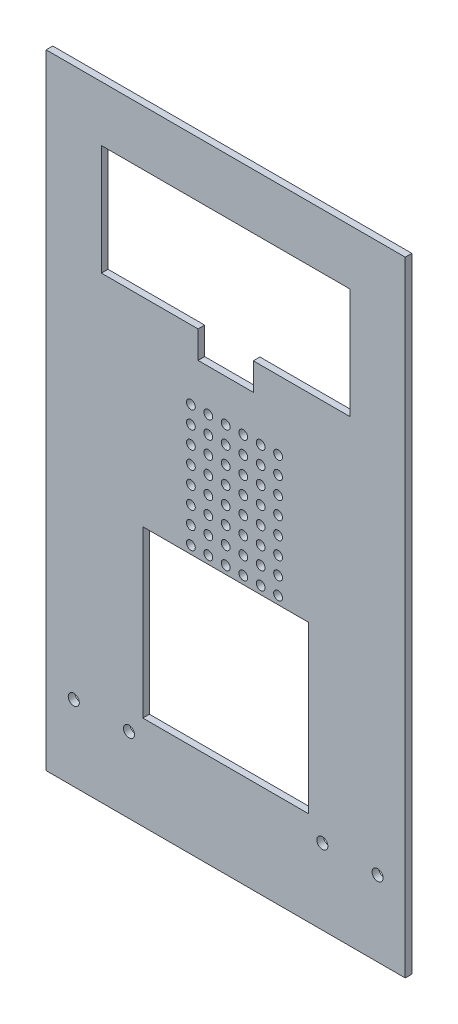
from build123d import *

# Parameters (mm, degrees)
SKETCH1_W           = 165.1
SKETCH1_H           = 292.1
BOSS_EXTRUDE1_DEPTH = 3.048
SKETCH2_R           = 10.7315
SKETCH2_R_2         = 2.0193
SKETCH2_W           = 16.173788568
SKETCH2_H           = 32.6898
SKETCH2_W_2         = 76.2
SKETCH2_H_2         = 76.2
CUT_EXTRUDE1_DEPTH  = 168.792715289
CUT_EXTRUDE2_DEPTH  = 168.792715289
SKETCH5_R           = 2.54
CUT_EXTRUDE3_DEPTH  = 168.792715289
SKETCH6_W           = 165.1
SKETCH6_H           = 5.08
CUT_EXTRUDE4_DEPTH  = 168.792715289


with BuildPart() as part:
    # Sketch1 → Boss-Extrude1 (new body)
    with BuildSketch(Plane.XY):
        Rectangle(SKETCH1_W, SKETCH1_H)
    extrude(amount=BOSS_EXTRUDE1_DEPTH)

    # Sketch2 → Cut-Extrude1 (cut, through all)
    with BuildSketch(Plane.XY):
        with Locations((0, 92.71)):
            Circle(SKETCH2_R)
        with Locations(Location((0, 38.1, 0), (0, 0, 180))):
            Circle(SKETCH2_R_2)
        with Locations(Location((0, 30.1, 0), (0, 0, 180))):
            Circle(SKETCH2_R_2)
        with Locations(Location((0, 22.1, 0), (0, 0, 180))):
            Circle(SKETCH2_R_2)
        with Locations(Location((0, 14.1, 0), (0, 0, 180))):
            Circle(SKETCH2_R_2)
        with Locations(Location((0, 6.1, 0), (0, 0, 180))):
            Circle(SKETCH2_R_2)
        with Locations(Location((0, -1.9, 0), (0, 0, 180))):
            Circle(SKETCH2_R_2)
        with Locations(Location((0, -9.9, 0), (0, 0, 180))):
            Circle(SKETCH2_R_2)
        with Locations(Location((0, -17.9, 0), (0, 0, 180))):
            Circle(SKETCH2_R_2)
        with Locations(Location((-8, 38.1, 0), (0, 0, 180))):
            Circle(SKETCH2_R_2)
        with Locations(Location((-16, 38.1, 0), (0, 0, 180))):
            Circle(SKETCH2_R_2)
        with Locations(Location((-8, 30.1, 0), (0, 0, 180))):
            Circle(SKETCH2_R_2)
        with Locations(Location((-16, 30.1, 0), (0, 0, 180))):
            Circle(SKETCH2_R_2)
        with Locations(Location((-8, 22.1, 0), (0, 0, 180))):
            Circle(SKETCH2_R_2)
        with Locations(Location((-16, 22.1, 0), (0, 0, 180))):
            Circle(SKETCH2_R_2)
        with Locations(Location((-8, 14.1, 0), (0, 0, 180))):
            Circle(SKETCH2_R_2)
        with Locations(Location((-16, 14.1, 0), (0, 0, 180))):
            Circle(SKETCH2_R_2)
        with Locations(Location((-8, 6.1, 0), (0, 0, 180))):
            Circle(SKETCH2_R_2)
        with Locations(Location((-16, 6.1, 0), (0, 0, 180))):
            Circle(SKETCH2_R_2)
        with Locations(Location((-8, -1.9, 0), (0, 0, 180))):
            Circle(SKETCH2_R_2)
        with Locations(Location((-16, -1.9, 0), (0, 0, 180))):
            Circle(SKETCH2_R_2)
        with Locations(Location((-8, -9.9, 0), (0, 0, 180))):
            Circle(SKETCH2_R_2)
        with Locations(Location((-16, -9.9, 0), (0, 0, 180))):
            Circle(SKETCH2_R_2)
        with Locations(Location((-8, -17.9, 0), (0, 0, 180))):
            Circle(SKETCH2_R_2)
        with Locations(Location((-16, -17.9, 0), (0, 0, 180))):
            Circle(SKETCH2_R_2)
        with Locations(Location((24.086894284, 14.1, 0), (0, 0, 180))):
            Circle(SKETCH2_R_2)
        with Locations(Location((8.086894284, 14.1, 0), (0, 0, 180))):
            Circle(SKETCH2_R_2)
        with Locations(Location((8.086894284, -17.9, 0), (0, 0, 180))):
            Circle(SKETCH2_R_2)
        with Locations(Location((24.086894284, 6.1, 0), (0, 0, 180))):
            Circle(SKETCH2_R_2)
        with Locations(Location((16.086894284, 6.1, 0), (0, 0, 180))):
            Circle(SKETCH2_R_2)
        with Locations(Location((8.086894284, -1.9, 0), (0, 0, 180))):
            Circle(SKETCH2_R_2)
        with Locations(Location((8.086894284, 30.1, 0), (0, 0, 180))):
            Circle(SKETCH2_R_2)
        with Locations(Location((24.086894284, 22.1, 0), (0, 0, 180))):
            Circle(SKETCH2_R_2)
        with Locations(Location((24.086894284, -1.9, 0), (0, 0, 180))):
            Circle(SKETCH2_R_2)
        with Locations(Location((24.086894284, -9.9, 0), (0, 0, 180))):
            Circle(SKETCH2_R_2)
        with Locations(Location((8.086894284, 6.1, 0), (0, 0, 180))):
            Circle(SKETCH2_R_2)
        with Locations(Location((16.086894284, 22.1, 0), (0, 0, 180))):
            Circle(SKETCH2_R_2)
        with Locations(Location((8.086894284, 22.1, 0), (0, 0, 180))):
            Circle(SKETCH2_R_2)
        with Locations(Location((8.086894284, -9.9, 0), (0, 0, 180))):
            Circle(SKETCH2_R_2)
        with Locations(Location((24.086894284, -17.9, 0), (0, 0, 180))):
            Circle(SKETCH2_R_2)
        with Locations(Location((16.086894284, 14.1, 0), (0, 0, 180))):
            Circle(SKETCH2_R_2)
        with Locations(Location((16.086894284, -17.9, 0), (0, 0, 180))):
            Circle(SKETCH2_R_2)
        with Locations(Location((16.086894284, 30.1, 0), (0, 0, 180))):
            Circle(SKETCH2_R_2)
        with Locations(Location((24.086894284, 30.1, 0), (0, 0, 180))):
            Circle(SKETCH2_R_2)
        with Locations(Location((16.086894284, -9.9, 0), (0, 0, 180))):
            Circle(SKETCH2_R_2)
        with Locations(Location((16.086894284, -1.9, 0), (0, 0, 180))):
            Circle(SKETCH2_R_2)
        with Locations(Location((16.086894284, 38.1, 0), (0, 0, 180))):
            Circle(SKETCH2_R_2)
        with Locations(Location((8.086894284, 38.1, 0), (0, 0, 180))):
            Circle(SKETCH2_R_2)
        with Locations(Location((24.086894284, 38.1, 0), (0, 0, 180))):
            Circle(SKETCH2_R_2)
        with Locations((0, 92.71)):
            Rectangle(SKETCH2_W, SKETCH2_H)
        with Locations((0, -59.69)):
            Rectangle(SKETCH2_W_2, SKETCH2_H_2)
    extrude(amount=CUT_EXTRUDE1_DEPTH, mode=Mode.SUBTRACT)

    # Sketch4 → Cut-Extrude2 (cut, through all)
    with BuildSketch(Plane.XY):
        Polygon((-12.7, 57.310847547), (-12.7, 69.85), (-57.15, 69.85), (-57.15, 120.65), (57.15, 120.65), (57.15, 69.85), (12.7, 69.85), (12.7, 57.310847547), align=None)
    extrude(amount=CUT_EXTRUDE2_DEPTH, mode=Mode.SUBTRACT)

    # Sketch5 → Cut-Extrude3 (cut, through all)
    with BuildSketch(Plane(origin=(0, 0, 0), x_dir=(-1, 0, 0), z_dir=(0, 0, -1))):
        with Locations((-44.45, -106.299)):
            Circle(SKETCH5_R)
        with Locations((-69.85, -106.299)):
            Circle(SKETCH5_R)
        with Locations((69.85, -106.299)):
            Circle(SKETCH5_R)
        with Locations((44.45, -106.299)):
            Circle(SKETCH5_R)
    extrude(amount=-CUT_EXTRUDE3_DEPTH, mode=Mode.SUBTRACT)

    # Sketch6 → Cut-Extrude4 (cut, through all)
    with BuildSketch(Plane(origin=(0, 0, 0), x_dir=(-1, 0, 0), z_dir=(0, 0, -1))):
        with Locations((0, -143.51)):
            Rectangle(SKETCH6_W, SKETCH6_H)
    extrude(amount=-CUT_EXTRUDE4_DEPTH, mode=Mode.SUBTRACT)


solid = part.part
